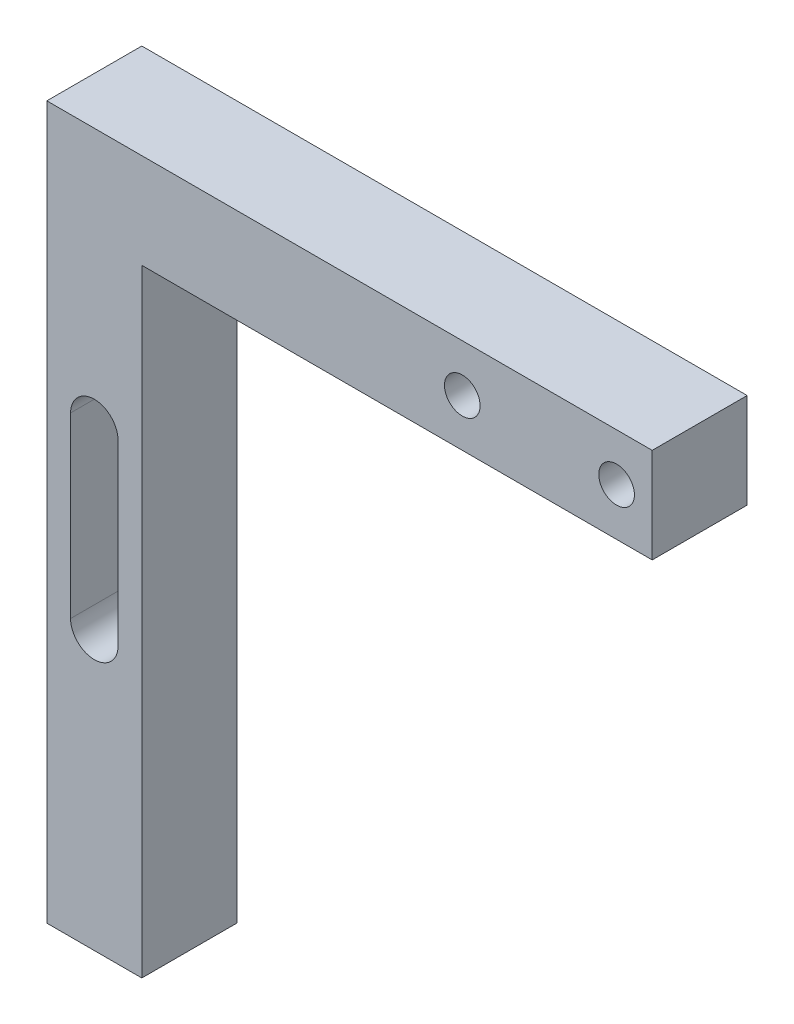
from build123d import *

# Parameters (mm, degrees)
SKETCH_4_R          = 1.5
EXTRUDE_2_DEPTH     = 8
SKETCH_5_R          = 1.5
CUT_EXTRUDE_2_DEPTH = 20


with BuildPart() as part:
    # Sketch 4 → Extrude 2 (new body)
    with BuildSketch(Plane.XY):
        Polygon((0, 0), (51, 0), (51, -8), (8, -8), (8, -60), (0, -60), align=None)
        with Locations((48, -4)):
            Circle(SKETCH_4_R, mode=Mode.SUBTRACT)
        with Locations((35, -4)):
            Circle(SKETCH_4_R, mode=Mode.SUBTRACT)
        with BuildLine():
            Line((6, -21.771342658), (6, -36.771342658))
            ThreePointArc((6, -36.771342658), (4, -38.771342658), (2, -36.771342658))
            Line((2, -36.771342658), (2, -21.771342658))
            ThreePointArc((2, -21.771342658), (4, -19.771342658), (6, -21.771342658))
        make_face(mode=Mode.SUBTRACT)
    extrude(amount=EXTRUDE_2_DEPTH)

    # Sketch 5 → Cut-Extrude 2 (cut)
    with BuildSketch(Plane.XZ.offset(60)):
        with Locations(Location((4, 4, 0), (0, 0, 270))):
            Circle(SKETCH_5_R)
    extrude(amount=-CUT_EXTRUDE_2_DEPTH, mode=Mode.SUBTRACT)


solid = part.part
